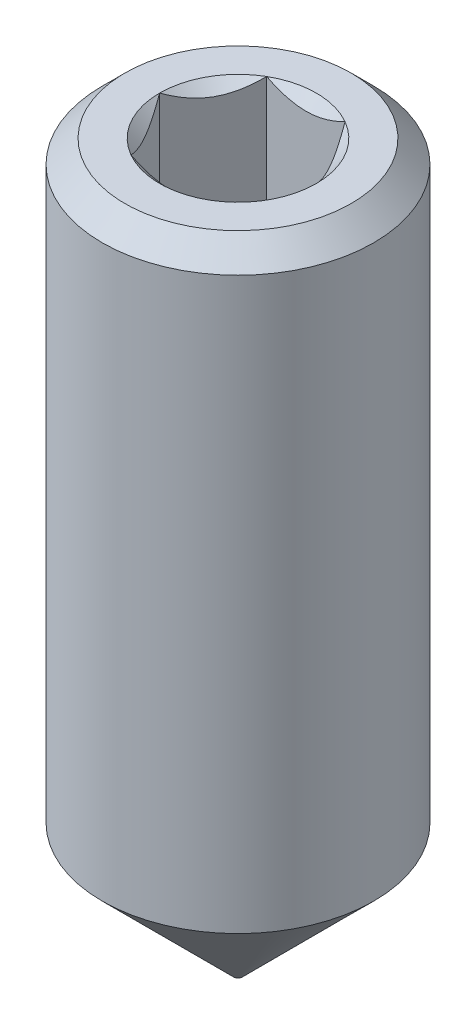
ISO-10303-21;
HEADER;
FILE_DESCRIPTION(('STEP AP214'),'2;1');
FILE_NAME('part.step','',(''),(''),'','','');
FILE_SCHEMA(('AUTOMOTIVE_DESIGN { 1 0 10303 214 1 1 1 1 }'));
ENDSEC;
DATA;
#1=APPLICATION_CONTEXT('core data for automotive mechanical design processes');
#2=APPLICATION_PROTOCOL_DEFINITION('international standard','automotive_design',2000,#1);
#3=PRODUCT_CONTEXT('',#1,'mechanical');
#4=PRODUCT('Part','Part','',(#3));
#5=PRODUCT_RELATED_PRODUCT_CATEGORY('part','',(#4));
#6=PRODUCT_DEFINITION_FORMATION('','',#4);
#7=PRODUCT_DEFINITION_CONTEXT('part definition',#1,'design');
#8=PRODUCT_DEFINITION('design','',#6,#7);
#9=PRODUCT_DEFINITION_SHAPE('','',#8);
#10=(LENGTH_UNIT() NAMED_UNIT(*) SI_UNIT(.MILLI.,.METRE.));
#11=(NAMED_UNIT(*) PLANE_ANGLE_UNIT() SI_UNIT($,.RADIAN.));
#12=(NAMED_UNIT(*) SI_UNIT($,.STERADIAN.) SOLID_ANGLE_UNIT());
#13=UNCERTAINTY_MEASURE_WITH_UNIT(LENGTH_MEASURE(1.E-05),#10,'distance_accuracy_value','');
#14=(GEOMETRIC_REPRESENTATION_CONTEXT(3) GLOBAL_UNCERTAINTY_ASSIGNED_CONTEXT((#13)) GLOBAL_UNIT_ASSIGNED_CONTEXT((#10,
#11,#12)) REPRESENTATION_CONTEXT('',''));
#15=CARTESIAN_POINT('',(0.,0.,0.));
#16=DIRECTION('',(0.,0.,1.));
#17=DIRECTION('',(1.,0.,0.));
#18=AXIS2_PLACEMENT_3D('',#15,#16,#17);
#19=CARTESIAN_POINT('',(0.,8.,0.));
#20=DIRECTION('',(0.,1.,0.));
#21=DIRECTION('',(0.,0.,1.));
#22=AXIS2_PLACEMENT_3D('',#19,#20,#21);
#23=PLANE('',#22);
#24=CARTESIAN_POINT('',(0.,8.,0.));
#25=DIRECTION('',(0.,1.,0.));
#26=DIRECTION('',(-1.,0.,0.));
#27=AXIS2_PLACEMENT_3D('',#24,#25,#26);
#28=CIRCLE('',#27,0.866025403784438);
#29=CARTESIAN_POINT('',(0.43301270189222,8.,0.75));
#30=VERTEX_POINT('',#29);
#31=CARTESIAN_POINT('',(0.866025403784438,8.,0.));
#32=VERTEX_POINT('',#31);
#33=EDGE_CURVE('E100',#30,#32,#28,.T.);
#34=ORIENTED_EDGE('',*,*,#33,.F.);
#35=CARTESIAN_POINT('',(-0.43301270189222,8.,0.75));
#36=VERTEX_POINT('',#35);
#37=EDGE_CURVE('E90',#36,#30,#28,.T.);
#38=ORIENTED_EDGE('',*,*,#37,.F.);
#39=CARTESIAN_POINT('',(-0.866025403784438,8.,0.));
#40=VERTEX_POINT('',#39);
#41=EDGE_CURVE('E99',#40,#36,#28,.T.);
#42=ORIENTED_EDGE('',*,*,#41,.F.);
#43=CARTESIAN_POINT('',(-0.433012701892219,8.,-0.75));
#44=VERTEX_POINT('',#43);
#45=EDGE_CURVE('E50',#44,#40,#28,.T.);
#46=ORIENTED_EDGE('',*,*,#45,.F.);
#47=CARTESIAN_POINT('',(0.433012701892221,8.,-0.749999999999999));
#48=VERTEX_POINT('',#47);
#49=EDGE_CURVE('E57',#48,#44,#28,.T.);
#50=ORIENTED_EDGE('',*,*,#49,.F.);
#51=EDGE_CURVE('E127',#32,#48,#28,.T.);
#52=ORIENTED_EDGE('',*,*,#51,.F.);
#53=EDGE_LOOP('',(#34,#38,#42,#46,#50,#52));
#54=FACE_BOUND('',#53,.T.);
#55=CARTESIAN_POINT('',(0.,8.,0.));
#56=DIRECTION('',(0.,-1.,0.));
#57=DIRECTION('',(0.,0.,-1.));
#58=AXIS2_PLACEMENT_3D('',#55,#56,#57);
#59=CIRCLE('',#58,1.25);
#60=CARTESIAN_POINT('',(0.,8.,-1.25));
#61=VERTEX_POINT('',#60);
#62=EDGE_CURVE('E44',#61,#61,#59,.T.);
#63=ORIENTED_EDGE('',*,*,#62,.F.);
#64=EDGE_LOOP('',(#63));
#65=FACE_BOUND('',#64,.T.);
#66=ADVANCED_FACE('F32',(#54,#65),#23,.T.);
#67=CARTESIAN_POINT('',(0.,7.75,0.));
#68=DIRECTION('',(0.,-1.,0.));
#69=DIRECTION('',(0.,0.,-1.));
#70=AXIS2_PLACEMENT_3D('',#67,#68,#69);
#71=CONICAL_SURFACE('',#70,1.5,0.78539816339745);
#72=ORIENTED_EDGE('',*,*,#62,.T.);
#73=EDGE_LOOP('',(#72));
#74=FACE_BOUND('',#73,.T.);
#75=CARTESIAN_POINT('',(0.,7.75,0.));
#76=DIRECTION('',(0.,-1.,0.));
#77=DIRECTION('',(0.,0.,-1.));
#78=AXIS2_PLACEMENT_3D('',#75,#76,#77);
#79=CIRCLE('',#78,1.5);
#80=CARTESIAN_POINT('',(0.,7.75,-1.5));
#81=VERTEX_POINT('',#80);
#82=EDGE_CURVE('E249',#81,#81,#79,.T.);
#83=ORIENTED_EDGE('',*,*,#82,.F.);
#84=EDGE_LOOP('',(#83));
#85=FACE_BOUND('',#84,.T.);
#86=ADVANCED_FACE('F187',(#74,#85),#71,.T.);
#87=CARTESIAN_POINT('',(0.,0.,0.));
#88=DIRECTION('',(0.,-1.,0.));
#89=DIRECTION('',(0.,0.,-1.));
#90=AXIS2_PLACEMENT_3D('',#87,#88,#89);
#91=CYLINDRICAL_SURFACE('',#90,1.5);
#92=ORIENTED_EDGE('',*,*,#82,.T.);
#93=EDGE_LOOP('',(#92));
#94=FACE_BOUND('',#93,.T.);
#95=CARTESIAN_POINT('',(0.,1.45,0.));
#96=DIRECTION('',(0.,-1.,0.));
#97=DIRECTION('',(0.,0.,-1.));
#98=AXIS2_PLACEMENT_3D('',#95,#96,#97);
#99=CIRCLE('',#98,1.5);
#100=CARTESIAN_POINT('',(0.,1.45,1.5));
#101=VERTEX_POINT('',#100);
#102=EDGE_CURVE('E246',#101,#101,#99,.T.);
#103=ORIENTED_EDGE('',*,*,#102,.F.);
#104=EDGE_LOOP('',(#103));
#105=FACE_BOUND('',#104,.T.);
#106=ADVANCED_FACE('F191',(#94,#105),#91,.T.);
#107=CARTESIAN_POINT('',(0.,0.,0.));
#108=DIRECTION('',(0.,1.,0.));
#109=DIRECTION('',(0.,0.,1.));
#110=AXIS2_PLACEMENT_3D('',#107,#108,#109);
#111=CONICAL_SURFACE('',#110,0.05,0.78539816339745);
#112=CARTESIAN_POINT('',(0.,0.,0.));
#113=DIRECTION('',(0.,-1.,0.));
#114=DIRECTION('',(0.,0.,-1.));
#115=AXIS2_PLACEMENT_3D('',#112,#113,#114);
#116=CIRCLE('',#115,0.05);
#117=CARTESIAN_POINT('',(0.,0.,0.05));
#118=VERTEX_POINT('',#117);
#119=EDGE_CURVE('E234',#118,#118,#116,.T.);
#120=CARTESIAN_POINT('',(0.,1.45,1.5));
#121=CARTESIAN_POINT('',(0.,1.43489583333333,1.48489583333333));
#122=CARTESIAN_POINT('',(0.,1.41979166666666,1.46979166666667));
#123=CARTESIAN_POINT('',(0.,1.38958333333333,1.43958333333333));
#124=CARTESIAN_POINT('',(0.,1.37447916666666,1.42447916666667));
#125=CARTESIAN_POINT('',(0.,1.34427083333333,1.39427083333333));
#126=CARTESIAN_POINT('',(0.,1.32916666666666,1.37916666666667));
#127=CARTESIAN_POINT('',(0.,1.29895833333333,1.34895833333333));
#128=CARTESIAN_POINT('',(0.,1.28385416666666,1.33385416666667));
#129=CARTESIAN_POINT('',(0.,1.25364583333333,1.30364583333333));
#130=CARTESIAN_POINT('',(0.,1.23854166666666,1.28854166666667));
#131=CARTESIAN_POINT('',(0.,1.20833333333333,1.25833333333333));
#132=CARTESIAN_POINT('',(0.,1.19322916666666,1.24322916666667));
#133=CARTESIAN_POINT('',(0.,1.16302083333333,1.21302083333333));
#134=CARTESIAN_POINT('',(0.,1.14791666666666,1.19791666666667));
#135=CARTESIAN_POINT('',(0.,1.11770833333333,1.16770833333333));
#136=CARTESIAN_POINT('',(0.,1.10260416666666,1.15260416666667));
#137=CARTESIAN_POINT('',(0.,1.07239583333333,1.12239583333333));
#138=CARTESIAN_POINT('',(0.,1.05729166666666,1.10729166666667));
#139=CARTESIAN_POINT('',(0.,1.02708333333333,1.07708333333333));
#140=CARTESIAN_POINT('',(0.,1.01197916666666,1.06197916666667));
#141=CARTESIAN_POINT('',(0.,0.981770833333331,1.03177083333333));
#142=CARTESIAN_POINT('',(0.,0.966666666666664,1.01666666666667));
#143=CARTESIAN_POINT('',(0.,0.936458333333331,0.986458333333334));
#144=CARTESIAN_POINT('',(0.,0.921354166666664,0.971354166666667));
#145=CARTESIAN_POINT('',(0.,0.891145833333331,0.941145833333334));
#146=CARTESIAN_POINT('',(0.,0.876041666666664,0.926041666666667));
#147=CARTESIAN_POINT('',(0.,0.845833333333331,0.895833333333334));
#148=CARTESIAN_POINT('',(0.,0.830729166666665,0.880729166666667));
#149=CARTESIAN_POINT('',(0.,0.800520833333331,0.850520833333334));
#150=CARTESIAN_POINT('',(0.,0.785416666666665,0.835416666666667));
#151=CARTESIAN_POINT('',(0.,0.755208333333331,0.805208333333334));
#152=CARTESIAN_POINT('',(0.,0.740104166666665,0.790104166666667));
#153=CARTESIAN_POINT('',(0.,0.709895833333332,0.759895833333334));
#154=CARTESIAN_POINT('',(0.,0.694791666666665,0.744791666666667));
#155=CARTESIAN_POINT('',(0.,0.664583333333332,0.714583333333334));
#156=CARTESIAN_POINT('',(0.,0.649479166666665,0.699479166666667));
#157=CARTESIAN_POINT('',(0.,0.619270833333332,0.669270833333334));
#158=CARTESIAN_POINT('',(0.,0.604166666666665,0.654166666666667));
#159=CARTESIAN_POINT('',(0.,0.573958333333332,0.623958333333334));
#160=CARTESIAN_POINT('',(0.,0.558854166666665,0.608854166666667));
#161=CARTESIAN_POINT('',(0.,0.528645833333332,0.578645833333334));
#162=CARTESIAN_POINT('',(0.,0.513541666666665,0.563541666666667));
#163=CARTESIAN_POINT('',(0.,0.483333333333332,0.533333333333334));
#164=CARTESIAN_POINT('',(0.,0.468229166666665,0.518229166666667));
#165=CARTESIAN_POINT('',(0.,0.438020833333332,0.488020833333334));
#166=CARTESIAN_POINT('',(0.,0.422916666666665,0.472916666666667));
#167=CARTESIAN_POINT('',(0.,0.392708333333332,0.442708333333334));
#168=CARTESIAN_POINT('',(0.,0.377604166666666,0.427604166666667));
#169=CARTESIAN_POINT('',(0.,0.347395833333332,0.397395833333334));
#170=CARTESIAN_POINT('',(0.,0.332291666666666,0.382291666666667));
#171=CARTESIAN_POINT('',(0.,0.302083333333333,0.352083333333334));
#172=CARTESIAN_POINT('',(0.,0.286979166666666,0.336979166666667));
#173=CARTESIAN_POINT('',(0.,0.256770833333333,0.306770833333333));
#174=CARTESIAN_POINT('',(0.,0.241666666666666,0.291666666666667));
#175=CARTESIAN_POINT('',(0.,0.211458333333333,0.261458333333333));
#176=CARTESIAN_POINT('',(0.,0.196354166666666,0.246354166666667));
#177=CARTESIAN_POINT('',(0.,0.166145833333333,0.216145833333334));
#178=CARTESIAN_POINT('',(0.,0.151041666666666,0.201041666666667));
#179=CARTESIAN_POINT('',(0.,0.120833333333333,0.170833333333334));
#180=CARTESIAN_POINT('',(0.,0.105729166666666,0.155729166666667));
#181=CARTESIAN_POINT('',(0.,0.075520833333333,0.125520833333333));
#182=CARTESIAN_POINT('',(0.,0.0604166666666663,0.110416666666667));
#183=CARTESIAN_POINT('',(0.,0.0302083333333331,0.0802083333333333));
#184=CARTESIAN_POINT('',(0.,0.0151041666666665,0.0651041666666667));
#185=CARTESIAN_POINT('',(0.,0.,0.05));
#186=B_SPLINE_CURVE_WITH_KNOTS('',3,(#120,#121,#122,#123,#124,#125,#126,#127,#128,#129,#130,
#131,#132,#133,#134,#135,#136,#137,#138,#139,#140,#141,#142,#143,#144,#145,#146,#147,#148,#149,
#150,#151,#152,#153,#154,#155,#156,#157,#158,#159,#160,#161,#162,#163,#164,#165,#166,#167,#168,
#169,#170,#171,#172,#173,#174,#175,#176,#177,#178,#179,#180,#181,#182,#183,#184,#185),
.UNSPECIFIED.,.F.,.F.,(4,2,2,2,2,2,2,2,2,2,2,2,2,2,2,2,2,2,2,2,2,2,2,2,2,2,2,2,2,2,2,2,4),(0.,
0.0640815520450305,0.128163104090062,0.192244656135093,0.256326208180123,0.320407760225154,
0.384489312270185,0.448570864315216,0.512652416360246,0.576733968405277,0.640815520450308,
0.704897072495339,0.76897862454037,0.833060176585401,0.897141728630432,0.961223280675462,
1.02530483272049,1.08938638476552,1.15346793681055,1.21754948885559,1.28163104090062,
1.34571259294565,1.40979414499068,1.47387569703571,1.53795724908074,1.60203880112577,
1.6661203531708,1.73020190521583,1.79428345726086,1.85836500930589,1.92244656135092,
1.98652811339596,2.05060966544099),.UNSPECIFIED.);
#187=EDGE_CURVE('BSEAM197',#101,#118,#186,.T.);
#188=ORIENTED_EDGE('',*,*,#102,.T.);
#189=ORIENTED_EDGE('',*,*,#119,.F.);
#190=ORIENTED_EDGE('',*,*,#187,.T.);
#191=ORIENTED_EDGE('',*,*,#187,.F.);
#192=EDGE_LOOP('',(#188,#190,#189,#191));
#193=FACE_BOUND('',#192,.T.);
#194=ADVANCED_FACE('F197',(#193),#111,.T.);
#195=CARTESIAN_POINT('',(0.05,0.,0.));
#196=DIRECTION('',(0.,-1.,0.));
#197=DIRECTION('',(0.,0.,-1.));
#198=AXIS2_PLACEMENT_3D('',#195,#196,#197);
#199=PLANE('',#198);
#200=ORIENTED_EDGE('',*,*,#119,.T.);
#201=EDGE_LOOP('',(#200));
#202=FACE_BOUND('',#201,.T.);
#203=ADVANCED_FACE('F205',(#202),#199,.T.);
#204=CARTESIAN_POINT('',(0.,8.,0.));
#205=DIRECTION('',(0.,1.,0.));
#206=DIRECTION('',(-1.,0.,0.));
#207=AXIS2_PLACEMENT_3D('',#204,#205,#206);
#208=CONICAL_SURFACE('',#207,0.866025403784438,0.78539816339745);
#209=ORIENTED_EDGE('',*,*,#33,.T.);
#210=CARTESIAN_POINT('',(0.432897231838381,8.00011549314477,0.7502));
#211=CARTESIAN_POINT('',(0.447787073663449,7.98523411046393,0.724410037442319));
#212=CARTESIAN_POINT('',(0.462925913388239,7.97122626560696,0.698188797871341));
#213=CARTESIAN_POINT('',(0.49379596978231,7.94557752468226,0.644720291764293));
#214=CARTESIAN_POINT('',(0.509530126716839,7.93395091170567,0.617467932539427));
#215=CARTESIAN_POINT('',(0.541257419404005,7.91403404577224,0.562514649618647));
#216=CARTESIAN_POINT('',(0.557242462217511,7.90569369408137,0.53482774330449));
#217=CARTESIAN_POINT('',(0.589564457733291,7.89284274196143,0.478844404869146));
#218=CARTESIAN_POINT('',(0.605900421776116,7.88832254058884,0.450549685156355));
#219=CARTESIAN_POINT('',(0.634052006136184,7.88424583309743,0.401789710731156));
#220=CARTESIAN_POINT('',(0.645830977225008,7.88364279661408,0.381387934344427));
#221=CARTESIAN_POINT('',(0.669366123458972,7.88465450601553,0.340623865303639));
#222=CARTESIAN_POINT('',(0.681122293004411,7.88626974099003,0.320261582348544));
#223=CARTESIAN_POINT('',(0.716222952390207,7.89433614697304,0.259465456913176));
#224=CARTESIAN_POINT('',(0.73939277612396,7.90400893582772,0.2193341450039));
#225=CARTESIAN_POINT('',(0.7800639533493,7.92735631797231,0.148889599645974));
#226=CARTESIAN_POINT('',(0.797755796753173,7.93980855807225,0.118246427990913));
#227=CARTESIAN_POINT('',(0.832446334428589,7.96785961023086,0.0581606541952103));
#228=CARTESIAN_POINT('',(0.849447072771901,7.98344818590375,0.0287145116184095));
#229=CARTESIAN_POINT('',(0.866140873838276,8.00011549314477,-0.000199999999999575));
#230=B_SPLINE_CURVE_WITH_KNOTS('',3,(#210,#211,#212,#213,#214,#215,#216,#217,#218,#219,#220,
#221,#222,#223,#224,#225,#226,#227,#228,#229),.UNSPECIFIED.,.F.,.F.,(4,2,2,2,2,2,2,2,2,4),(0.,
0.0999419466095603,0.200466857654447,0.299393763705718,0.398071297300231,0.468665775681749,
0.53927582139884,0.680536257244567,0.792918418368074,0.904939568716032),.UNSPECIFIED.);
#231=EDGE_CURVE('E11',#30,#32,#230,.T.);
#232=ORIENTED_EDGE('',*,*,#231,.F.);
#233=EDGE_LOOP('',(#209,#232));
#234=FACE_BOUND('',#233,.T.);
#235=ADVANCED_FACE('F104',(#234),#208,.F.);
#236=ORIENTED_EDGE('',*,*,#51,.T.);
#237=CARTESIAN_POINT('',(0.866140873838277,8.00011549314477,0.000200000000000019));
#238=CARTESIAN_POINT('',(0.851251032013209,7.98523411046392,-0.0255899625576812));
#239=CARTESIAN_POINT('',(0.836112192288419,7.97122626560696,-0.0518112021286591));
#240=CARTESIAN_POINT('',(0.805242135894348,7.94557752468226,-0.105279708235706));
#241=CARTESIAN_POINT('',(0.789507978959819,7.93395091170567,-0.132532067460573));
#242=CARTESIAN_POINT('',(0.757780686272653,7.91403404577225,-0.187485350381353));
#243=CARTESIAN_POINT('',(0.741795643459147,7.90569369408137,-0.21517225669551));
#244=CARTESIAN_POINT('',(0.709473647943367,7.89284274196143,-0.271155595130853));
#245=CARTESIAN_POINT('',(0.693137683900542,7.88832254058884,-0.299450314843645));
#246=CARTESIAN_POINT('',(0.664986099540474,7.88424583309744,-0.348210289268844));
#247=CARTESIAN_POINT('',(0.65320712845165,7.88364279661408,-0.368612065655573));
#248=CARTESIAN_POINT('',(0.629671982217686,7.88465450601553,-0.409376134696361));
#249=CARTESIAN_POINT('',(0.617915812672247,7.88626974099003,-0.429738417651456));
#250=CARTESIAN_POINT('',(0.582815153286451,7.89433614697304,-0.490534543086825));
#251=CARTESIAN_POINT('',(0.559645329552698,7.90400893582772,-0.5306658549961));
#252=CARTESIAN_POINT('',(0.518974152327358,7.92735631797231,-0.601110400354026));
#253=CARTESIAN_POINT('',(0.501282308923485,7.93980855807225,-0.631753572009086));
#254=CARTESIAN_POINT('',(0.466591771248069,7.96785961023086,-0.691839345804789));
#255=CARTESIAN_POINT('',(0.449591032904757,7.98344818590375,-0.72128548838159));
#256=CARTESIAN_POINT('',(0.432897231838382,8.00011549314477,-0.7502));
#257=B_SPLINE_CURVE_WITH_KNOTS('',3,(#237,#238,#239,#240,#241,#242,#243,#244,#245,#246,#247,
#248,#249,#250,#251,#252,#253,#254,#255,#256),.UNSPECIFIED.,.F.,.F.,(4,2,2,2,2,2,2,2,2,4),(0.,
0.0999419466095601,0.200466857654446,0.299393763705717,0.398071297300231,0.468665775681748,
0.53927582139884,0.680536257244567,0.792918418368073,0.904939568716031),.UNSPECIFIED.);
#258=EDGE_CURVE('E129',#32,#48,#257,.T.);
#259=ORIENTED_EDGE('',*,*,#258,.F.);
#260=EDGE_LOOP('',(#236,#259));
#261=FACE_BOUND('',#260,.T.);
#262=ADVANCED_FACE('F272',(#261),#208,.F.);
#263=ORIENTED_EDGE('',*,*,#49,.T.);
#264=CARTESIAN_POINT('',(-0.863604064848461,8.27778925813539,-0.749999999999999));
#265=CARTESIAN_POINT('',(-0.84257587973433,8.26191493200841,-0.749999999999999));
#266=CARTESIAN_POINT('',(-0.821430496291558,8.246196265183,-0.749999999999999));
#267=CARTESIAN_POINT('',(-0.778857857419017,8.21513452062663,-0.749999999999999));
#268=CARTESIAN_POINT('',(-0.757430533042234,8.19979153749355,-0.749999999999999));
#269=CARTESIAN_POINT('',(-0.692340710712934,8.15420358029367,-0.749999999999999));
#270=CARTESIAN_POINT('',(-0.648190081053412,8.12464409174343,-0.75));
#271=CARTESIAN_POINT('',(-0.555607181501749,8.0666155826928,-0.75));
#272=CARTESIAN_POINT('',(-0.507074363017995,8.0383051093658,-0.75));
#273=CARTESIAN_POINT('',(-0.407587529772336,7.98651811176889,-0.75));
#274=CARTESIAN_POINT('',(-0.35664241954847,7.96302529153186,-0.75));
#275=CARTESIAN_POINT('',(-0.28016546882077,7.93428689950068,-0.75));
#276=CARTESIAN_POINT('',(-0.255770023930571,7.92603927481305,-0.75));
#277=CARTESIAN_POINT('',(-0.206403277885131,7.91149717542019,-0.75));
#278=CARTESIAN_POINT('',(-0.181431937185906,7.90520283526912,-0.75));
#279=CARTESIAN_POINT('',(-0.106699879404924,7.8899931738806,-0.75));
#280=CARTESIAN_POINT('',(-0.0561907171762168,7.8843771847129,-0.75));
#281=CARTESIAN_POINT('',(0.0430767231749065,7.88362825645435,-0.75));
#282=CARTESIAN_POINT('',(0.0918322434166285,7.88812345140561,-0.75));
#283=CARTESIAN_POINT('',(0.164112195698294,7.90133730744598,-0.75));
#284=CARTESIAN_POINT('',(0.188278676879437,7.90690144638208,-0.75));
#285=CARTESIAN_POINT('',(0.236094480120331,7.91992316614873,-0.75));
#286=CARTESIAN_POINT('',(0.259743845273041,7.92738058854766,-0.75));
#287=CARTESIAN_POINT('',(0.334198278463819,7.95366646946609,-0.75));
#288=CARTESIAN_POINT('',(0.383940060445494,7.97549033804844,-0.75));
#289=CARTESIAN_POINT('',(0.481089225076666,8.02401180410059,-0.75));
#290=CARTESIAN_POINT('',(0.528487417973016,8.05072691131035,-0.75));
#291=CARTESIAN_POINT('',(0.619071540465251,8.10584285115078,-0.75));
#292=CARTESIAN_POINT('',(0.662349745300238,8.13409394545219,-0.75));
#293=CARTESIAN_POINT('',(0.726111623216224,8.17776714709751,-0.75));
#294=CARTESIAN_POINT('',(0.74709041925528,8.1924788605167,-0.75));
#295=CARTESIAN_POINT('',(0.78876134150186,8.2222913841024,-0.75));
#296=CARTESIAN_POINT('',(0.809453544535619,8.23739208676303,-0.75));
#297=CARTESIAN_POINT('',(0.830026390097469,8.25265408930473,-0.75));
#298=B_SPLINE_CURVE_WITH_KNOTS('',3,(#264,#265,#266,#267,#268,#269,#270,#271,#272,#273,#274,
#275,#276,#277,#278,#279,#280,#281,#282,#283,#284,#285,#286,#287,#288,#289,#290,#291,#292,#293,
#294,#295,#296,#297),.UNSPECIFIED.,.F.,.F.,(4,2,2,2,2,2,2,2,2,2,2,2,2,2,2,2,4),(0.,
0.0790398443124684,0.158099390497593,0.3174252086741,0.485845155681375,0.653685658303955,
0.730869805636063,0.808059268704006,0.959469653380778,1.10540290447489,1.17973203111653,
1.25405493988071,1.41653726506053,1.57961304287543,1.73458511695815,1.81145152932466,
1.8882969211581),.UNSPECIFIED.);
#299=EDGE_CURVE('E136',#48,#44,#298,.F.);
#300=ORIENTED_EDGE('',*,*,#299,.F.);
#301=EDGE_LOOP('',(#263,#300));
#302=FACE_BOUND('',#301,.T.);
#303=ADVANCED_FACE('F268',(#302),#208,.F.);
#304=ORIENTED_EDGE('',*,*,#45,.T.);
#305=CARTESIAN_POINT('',(-0.432897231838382,8.00011549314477,-0.7502));
#306=CARTESIAN_POINT('',(-0.44778707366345,7.98523411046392,-0.724410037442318));
#307=CARTESIAN_POINT('',(-0.462925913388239,7.97122626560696,-0.698188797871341));
#308=CARTESIAN_POINT('',(-0.49379596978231,7.94557752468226,-0.644720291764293));
#309=CARTESIAN_POINT('',(-0.509530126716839,7.93395091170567,-0.617467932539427));
#310=CARTESIAN_POINT('',(-0.541257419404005,7.91403404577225,-0.562514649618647));
#311=CARTESIAN_POINT('',(-0.557242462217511,7.90569369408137,-0.53482774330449));
#312=CARTESIAN_POINT('',(-0.589564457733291,7.89284274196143,-0.478844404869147));
#313=CARTESIAN_POINT('',(-0.605900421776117,7.88832254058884,-0.450549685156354));
#314=CARTESIAN_POINT('',(-0.634052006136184,7.88424583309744,-0.401789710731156));
#315=CARTESIAN_POINT('',(-0.645830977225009,7.88364279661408,-0.381387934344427));
#316=CARTESIAN_POINT('',(-0.669366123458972,7.88465450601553,-0.340623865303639));
#317=CARTESIAN_POINT('',(-0.681122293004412,7.88626974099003,-0.320261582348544));
#318=CARTESIAN_POINT('',(-0.716222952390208,7.89433614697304,-0.259465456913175));
#319=CARTESIAN_POINT('',(-0.739392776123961,7.90400893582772,-0.2193341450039));
#320=CARTESIAN_POINT('',(-0.7800639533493,7.92735631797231,-0.148889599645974));
#321=CARTESIAN_POINT('',(-0.797755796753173,7.93980855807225,-0.118246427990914));
#322=CARTESIAN_POINT('',(-0.832446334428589,7.96785961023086,-0.0581606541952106));
#323=CARTESIAN_POINT('',(-0.849447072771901,7.98344818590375,-0.0287145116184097));
#324=CARTESIAN_POINT('',(-0.866140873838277,8.00011549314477,0.000199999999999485));
#325=B_SPLINE_CURVE_WITH_KNOTS('',3,(#305,#306,#307,#308,#309,#310,#311,#312,#313,#314,#315,
#316,#317,#318,#319,#320,#321,#322,#323,#324),.UNSPECIFIED.,.F.,.F.,(4,2,2,2,2,2,2,2,2,4),(0.,
0.0999419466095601,0.200466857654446,0.299393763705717,0.39807129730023,0.468665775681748,
0.53927582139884,0.680536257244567,0.792918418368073,0.904939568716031),.UNSPECIFIED.);
#326=EDGE_CURVE('E155',#44,#40,#325,.T.);
#327=ORIENTED_EDGE('',*,*,#326,.F.);
#328=EDGE_LOOP('',(#304,#327));
#329=FACE_BOUND('',#328,.T.);
#330=ADVANCED_FACE('F264',(#329),#208,.F.);
#331=ORIENTED_EDGE('',*,*,#41,.T.);
#332=CARTESIAN_POINT('',(-0.866140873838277,8.00011549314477,-0.00020000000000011));
#333=CARTESIAN_POINT('',(-0.851251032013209,7.98523411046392,0.0255899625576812));
#334=CARTESIAN_POINT('',(-0.836112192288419,7.97122626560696,0.0518112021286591));
#335=CARTESIAN_POINT('',(-0.805242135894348,7.94557752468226,0.105279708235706));
#336=CARTESIAN_POINT('',(-0.78950797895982,7.93395091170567,0.132532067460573));
#337=CARTESIAN_POINT('',(-0.757780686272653,7.91403404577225,0.187485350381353));
#338=CARTESIAN_POINT('',(-0.741795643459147,7.90569369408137,0.21517225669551));
#339=CARTESIAN_POINT('',(-0.709473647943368,7.89284274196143,0.271155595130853));
#340=CARTESIAN_POINT('',(-0.693137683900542,7.88832254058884,0.299450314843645));
#341=CARTESIAN_POINT('',(-0.664986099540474,7.88424583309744,0.348210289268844));
#342=CARTESIAN_POINT('',(-0.65320712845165,7.88364279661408,0.368612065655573));
#343=CARTESIAN_POINT('',(-0.629671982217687,7.88465450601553,0.409376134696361));
#344=CARTESIAN_POINT('',(-0.617915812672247,7.88626974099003,0.429738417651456));
#345=CARTESIAN_POINT('',(-0.582815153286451,7.89433614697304,0.490534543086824));
#346=CARTESIAN_POINT('',(-0.559645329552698,7.90400893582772,0.5306658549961));
#347=CARTESIAN_POINT('',(-0.518974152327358,7.92735631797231,0.601110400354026));
#348=CARTESIAN_POINT('',(-0.501282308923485,7.93980855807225,0.631753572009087));
#349=CARTESIAN_POINT('',(-0.466591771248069,7.96785961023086,0.69183934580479));
#350=CARTESIAN_POINT('',(-0.449591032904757,7.98344818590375,0.721285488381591));
#351=CARTESIAN_POINT('',(-0.432897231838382,8.00011549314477,0.7502));
#352=B_SPLINE_CURVE_WITH_KNOTS('',3,(#332,#333,#334,#335,#336,#337,#338,#339,#340,#341,#342,
#343,#344,#345,#346,#347,#348,#349,#350,#351),.UNSPECIFIED.,.F.,.F.,(4,2,2,2,2,2,2,2,2,4),(0.,
0.0999419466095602,0.200466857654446,0.299393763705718,0.398071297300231,0.468665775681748,
0.53927582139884,0.680536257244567,0.792918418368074,0.904939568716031),.UNSPECIFIED.);
#353=EDGE_CURVE('E116',#40,#36,#352,.T.);
#354=ORIENTED_EDGE('',*,*,#353,.F.);
#355=EDGE_LOOP('',(#331,#354));
#356=FACE_BOUND('',#355,.T.);
#357=ADVANCED_FACE('F148',(#356),#208,.F.);
#358=ORIENTED_EDGE('',*,*,#37,.T.);
#359=CARTESIAN_POINT('',(-0.863604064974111,8.27778925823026,0.75));
#360=CARTESIAN_POINT('',(-0.842575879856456,8.26191493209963,0.75));
#361=CARTESIAN_POINT('',(-0.821430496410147,8.24619626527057,0.75));
#362=CARTESIAN_POINT('',(-0.778857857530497,8.21513452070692,0.75));
#363=CARTESIAN_POINT('',(-0.757430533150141,8.19979153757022,0.75));
#364=CARTESIAN_POINT('',(-0.692340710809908,8.15420358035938,0.75));
#365=CARTESIAN_POINT('',(-0.648190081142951,8.12464409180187,0.75));
#366=CARTESIAN_POINT('',(-0.555607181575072,8.06661558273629,0.75));
#367=CARTESIAN_POINT('',(-0.507074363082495,8.03830510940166,0.75));
#368=CARTESIAN_POINT('',(-0.40758752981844,7.98651811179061,0.75));
#369=CARTESIAN_POINT('',(-0.356642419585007,7.96302529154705,0.75));
#370=CARTESIAN_POINT('',(-0.28016546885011,7.93428689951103,0.75));
#371=CARTESIAN_POINT('',(-0.255770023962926,7.9260392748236,0.75));
#372=CARTESIAN_POINT('',(-0.20640327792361,7.91149717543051,0.75));
#373=CARTESIAN_POINT('',(-0.181431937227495,7.90520283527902,0.75));
#374=CARTESIAN_POINT('',(-0.106699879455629,7.88999317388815,0.75));
#375=CARTESIAN_POINT('',(-0.0561907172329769,7.88437718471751,0.75));
#376=CARTESIAN_POINT('',(0.0430767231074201,7.88362825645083,0.75));
#377=CARTESIAN_POINT('',(0.0918322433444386,7.88812345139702,0.75));
#378=CARTESIAN_POINT('',(0.164112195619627,7.90133730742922,0.75));
#379=CARTESIAN_POINT('',(0.188278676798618,7.90690144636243,0.75));
#380=CARTESIAN_POINT('',(0.236094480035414,7.91992316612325,0.75));
#381=CARTESIAN_POINT('',(0.259743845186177,7.92738058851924,0.75));
#382=CARTESIAN_POINT('',(0.334198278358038,7.95366646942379,0.75));
#383=CARTESIAN_POINT('',(0.383940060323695,7.97549033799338,0.75));
#384=CARTESIAN_POINT('',(0.481089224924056,8.02401180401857,0.75));
#385=CARTESIAN_POINT('',(0.528487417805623,8.05072691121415,0.75));
#386=CARTESIAN_POINT('',(0.619071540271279,8.10584285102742,0.75));
#387=CARTESIAN_POINT('',(0.662349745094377,8.13409394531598,0.75));
#388=CARTESIAN_POINT('',(0.726111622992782,8.1777671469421,0.75));
#389=CARTESIAN_POINT('',(0.747090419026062,8.19247886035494,0.75));
#390=CARTESIAN_POINT('',(0.788761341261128,8.22229138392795,0.75));
#391=CARTESIAN_POINT('',(0.80945354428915,8.23739208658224,0.75));
#392=CARTESIAN_POINT('',(0.830026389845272,8.25265408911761,0.75));
#393=B_SPLINE_CURVE_WITH_KNOTS('',3,(#359,#360,#361,#362,#363,#364,#365,#366,#367,#368,#369,
#370,#371,#372,#373,#374,#375,#376,#377,#378,#379,#380,#381,#382,#383,#384,#385,#386,#387,#388,
#389,#390,#391,#392),.UNSPECIFIED.,.F.,.F.,(4,2,2,2,2,2,2,2,2,2,2,2,2,2,2,2,4),(0.,
0.0790398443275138,0.158099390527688,0.317425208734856,0.485845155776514,0.653685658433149,
0.73086980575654,0.808059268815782,0.959469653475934,1.10540290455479,1.1797320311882,
1.25405493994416,1.41653726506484,1.57961304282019,1.73458511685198,1.81145152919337,
1.88829692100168),.UNSPECIFIED.);
#394=EDGE_CURVE('E94',#36,#30,#393,.T.);
#395=ORIENTED_EDGE('',*,*,#394,.F.);
#396=EDGE_LOOP('',(#358,#395));
#397=FACE_BOUND('',#396,.T.);
#398=ADVANCED_FACE('F92',(#397),#208,.F.);
#399=CARTESIAN_POINT('',(1.29903810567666,6.5,0.75));
#400=DIRECTION('',(0.,1.,0.));
#401=DIRECTION('',(0.,0.,1.));
#402=AXIS2_PLACEMENT_3D('',#399,#400,#401);
#403=PLANE('',#402);
#404=DIRECTION('',(1.,0.,0.));
#405=VECTOR('',#404,1.);
#406=CARTESIAN_POINT('',(-0.43301270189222,6.5,0.75));
#407=LINE('',#406,#405);
#408=CARTESIAN_POINT('',(-0.43301270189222,6.5,0.75));
#409=VERTEX_POINT('',#408);
#410=CARTESIAN_POINT('',(0.433012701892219,6.5,0.75));
#411=VERTEX_POINT('',#410);
#412=EDGE_CURVE('E115',#409,#411,#407,.T.);
#413=ORIENTED_EDGE('',*,*,#412,.T.);
#414=DIRECTION('',(0.5,0.,-0.866025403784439));
#415=VECTOR('',#414,1.);
#416=CARTESIAN_POINT('',(0.433012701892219,6.5,0.75));
#417=LINE('',#416,#415);
#418=CARTESIAN_POINT('',(0.866025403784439,6.5,0.));
#419=VERTEX_POINT('',#418);
#420=EDGE_CURVE('E120',#411,#419,#417,.T.);
#421=ORIENTED_EDGE('',*,*,#420,.T.);
#422=DIRECTION('',(-0.5,0.,-0.866025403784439));
#423=VECTOR('',#422,1.);
#424=CARTESIAN_POINT('',(0.866025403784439,6.5,0.));
#425=LINE('',#424,#423);
#426=CARTESIAN_POINT('',(0.43301270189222,6.5,-0.75));
#427=VERTEX_POINT('',#426);
#428=EDGE_CURVE('E223',#419,#427,#425,.T.);
#429=ORIENTED_EDGE('',*,*,#428,.T.);
#430=DIRECTION('',(-1.,0.,0.));
#431=VECTOR('',#430,1.);
#432=CARTESIAN_POINT('',(0.43301270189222,6.5,-0.75));
#433=LINE('',#432,#431);
#434=CARTESIAN_POINT('',(-0.43301270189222,6.5,-0.75));
#435=VERTEX_POINT('',#434);
#436=EDGE_CURVE('E227',#427,#435,#433,.T.);
#437=ORIENTED_EDGE('',*,*,#436,.T.);
#438=DIRECTION('',(-0.5,0.,0.866025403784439));
#439=VECTOR('',#438,1.);
#440=CARTESIAN_POINT('',(-0.43301270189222,6.5,-0.75));
#441=LINE('',#440,#439);
#442=CARTESIAN_POINT('',(-0.866025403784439,6.5,0.));
#443=VERTEX_POINT('',#442);
#444=EDGE_CURVE('E230',#435,#443,#441,.T.);
#445=ORIENTED_EDGE('',*,*,#444,.T.);
#446=DIRECTION('',(0.5,0.,0.866025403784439));
#447=VECTOR('',#446,1.);
#448=CARTESIAN_POINT('',(-0.866025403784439,6.5,0.));
#449=LINE('',#448,#447);
#450=EDGE_CURVE('E123',#443,#409,#449,.T.);
#451=ORIENTED_EDGE('',*,*,#450,.T.);
#452=EDGE_LOOP('',(#413,#421,#429,#437,#445,#451));
#453=FACE_BOUND('',#452,.T.);
#454=ADVANCED_FACE('F147',(#453),#403,.T.);
#455=CARTESIAN_POINT('',(0.433012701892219,6.5,0.75));
#456=DIRECTION('',(0.866025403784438,0.,0.5));
#457=DIRECTION('',(0.5,0.,-0.866025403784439));
#458=AXIS2_PLACEMENT_3D('',#455,#456,#457);
#459=PLANE('',#458);
#460=DIRECTION('',(0.,1.,0.));
#461=VECTOR('',#460,1.);
#462=CARTESIAN_POINT('',(0.433012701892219,6.5,0.75));
#463=LINE('',#462,#461);
#464=EDGE_CURVE('E111',#411,#30,#463,.T.);
#465=ORIENTED_EDGE('',*,*,#464,.T.);
#466=ORIENTED_EDGE('',*,*,#231,.T.);
#467=DIRECTION('',(0.,1.,0.));
#468=VECTOR('',#467,1.);
#469=CARTESIAN_POINT('',(0.866025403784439,6.5,0.));
#470=LINE('',#469,#468);
#471=EDGE_CURVE('E122',#419,#32,#470,.T.);
#472=ORIENTED_EDGE('',*,*,#471,.F.);
#473=ORIENTED_EDGE('',*,*,#420,.F.);
#474=EDGE_LOOP('',(#465,#466,#472,#473));
#475=FACE_BOUND('',#474,.T.);
#476=ADVANCED_FACE('F118',(#475),#459,.F.);
#477=CARTESIAN_POINT('',(0.866025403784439,6.5,0.));
#478=DIRECTION('',(0.866025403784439,0.,-0.5));
#479=DIRECTION('',(-0.5,0.,-0.866025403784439));
#480=AXIS2_PLACEMENT_3D('',#477,#478,#479);
#481=PLANE('',#480);
#482=ORIENTED_EDGE('',*,*,#471,.T.);
#483=ORIENTED_EDGE('',*,*,#258,.T.);
#484=DIRECTION('',(0.,1.,0.));
#485=VECTOR('',#484,1.);
#486=CARTESIAN_POINT('',(0.43301270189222,6.5,-0.75));
#487=LINE('',#486,#485);
#488=EDGE_CURVE('E241',#427,#48,#487,.T.);
#489=ORIENTED_EDGE('',*,*,#488,.F.);
#490=ORIENTED_EDGE('',*,*,#428,.F.);
#491=EDGE_LOOP('',(#482,#483,#489,#490));
#492=FACE_BOUND('',#491,.T.);
#493=ADVANCED_FACE('F142',(#492),#481,.F.);
#494=CARTESIAN_POINT('',(0.43301270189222,6.5,-0.75));
#495=DIRECTION('',(0.,0.,-1.));
#496=DIRECTION('',(-1.,0.,0.));
#497=AXIS2_PLACEMENT_3D('',#494,#495,#496);
#498=PLANE('',#497);
#499=ORIENTED_EDGE('',*,*,#488,.T.);
#500=ORIENTED_EDGE('',*,*,#299,.T.);
#501=DIRECTION('',(0.,1.,0.));
#502=VECTOR('',#501,1.);
#503=CARTESIAN_POINT('',(-0.43301270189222,6.5,-0.75));
#504=LINE('',#503,#502);
#505=EDGE_CURVE('E238',#435,#44,#504,.T.);
#506=ORIENTED_EDGE('',*,*,#505,.F.);
#507=ORIENTED_EDGE('',*,*,#436,.F.);
#508=EDGE_LOOP('',(#499,#500,#506,#507));
#509=FACE_BOUND('',#508,.T.);
#510=ADVANCED_FACE('F176',(#509),#498,.F.);
#511=CARTESIAN_POINT('',(-0.43301270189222,6.5,-0.75));
#512=DIRECTION('',(-0.866025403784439,0.,-0.5));
#513=DIRECTION('',(-0.5,0.,0.866025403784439));
#514=AXIS2_PLACEMENT_3D('',#511,#512,#513);
#515=PLANE('',#514);
#516=ORIENTED_EDGE('',*,*,#505,.T.);
#517=ORIENTED_EDGE('',*,*,#326,.T.);
#518=DIRECTION('',(0.,1.,0.));
#519=VECTOR('',#518,1.);
#520=CARTESIAN_POINT('',(-0.866025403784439,6.5,0.));
#521=LINE('',#520,#519);
#522=EDGE_CURVE('E235',#443,#40,#521,.T.);
#523=ORIENTED_EDGE('',*,*,#522,.F.);
#524=ORIENTED_EDGE('',*,*,#444,.F.);
#525=EDGE_LOOP('',(#516,#517,#523,#524));
#526=FACE_BOUND('',#525,.T.);
#527=ADVANCED_FACE('F172',(#526),#515,.F.);
#528=CARTESIAN_POINT('',(-0.866025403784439,6.5,0.));
#529=DIRECTION('',(-0.866025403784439,0.,0.5));
#530=DIRECTION('',(0.5,0.,0.866025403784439));
#531=AXIS2_PLACEMENT_3D('',#528,#529,#530);
#532=PLANE('',#531);
#533=ORIENTED_EDGE('',*,*,#522,.T.);
#534=ORIENTED_EDGE('',*,*,#353,.T.);
#535=DIRECTION('',(0.,1.,0.));
#536=VECTOR('',#535,1.);
#537=CARTESIAN_POINT('',(-0.43301270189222,6.5,0.75));
#538=LINE('',#537,#536);
#539=EDGE_CURVE('E113',#409,#36,#538,.T.);
#540=ORIENTED_EDGE('',*,*,#539,.F.);
#541=ORIENTED_EDGE('',*,*,#450,.F.);
#542=EDGE_LOOP('',(#533,#534,#540,#541));
#543=FACE_BOUND('',#542,.T.);
#544=ADVANCED_FACE('F169',(#543),#532,.F.);
#545=CARTESIAN_POINT('',(-0.43301270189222,6.5,0.75));
#546=DIRECTION('',(0.,0.,1.));
#547=DIRECTION('',(1.,0.,0.));
#548=AXIS2_PLACEMENT_3D('',#545,#546,#547);
#549=PLANE('',#548);
#550=ORIENTED_EDGE('',*,*,#539,.T.);
#551=ORIENTED_EDGE('',*,*,#394,.T.);
#552=ORIENTED_EDGE('',*,*,#464,.F.);
#553=ORIENTED_EDGE('',*,*,#412,.F.);
#554=EDGE_LOOP('',(#550,#551,#552,#553));
#555=FACE_BOUND('',#554,.T.);
#556=ADVANCED_FACE('F109',(#555),#549,.F.);
#557=CLOSED_SHELL('',(#66,#86,#106,#194,#203,#235,#262,#303,#330,#357,#398,#454,#476,#493,#510,
#527,#544,#556));
#558=MANIFOLD_SOLID_BREP('B2',#557);
#559=ADVANCED_BREP_SHAPE_REPRESENTATION('',(#18,#558),#14);
#560=SHAPE_DEFINITION_REPRESENTATION(#9,#559);
ENDSEC;
END-ISO-10303-21;
